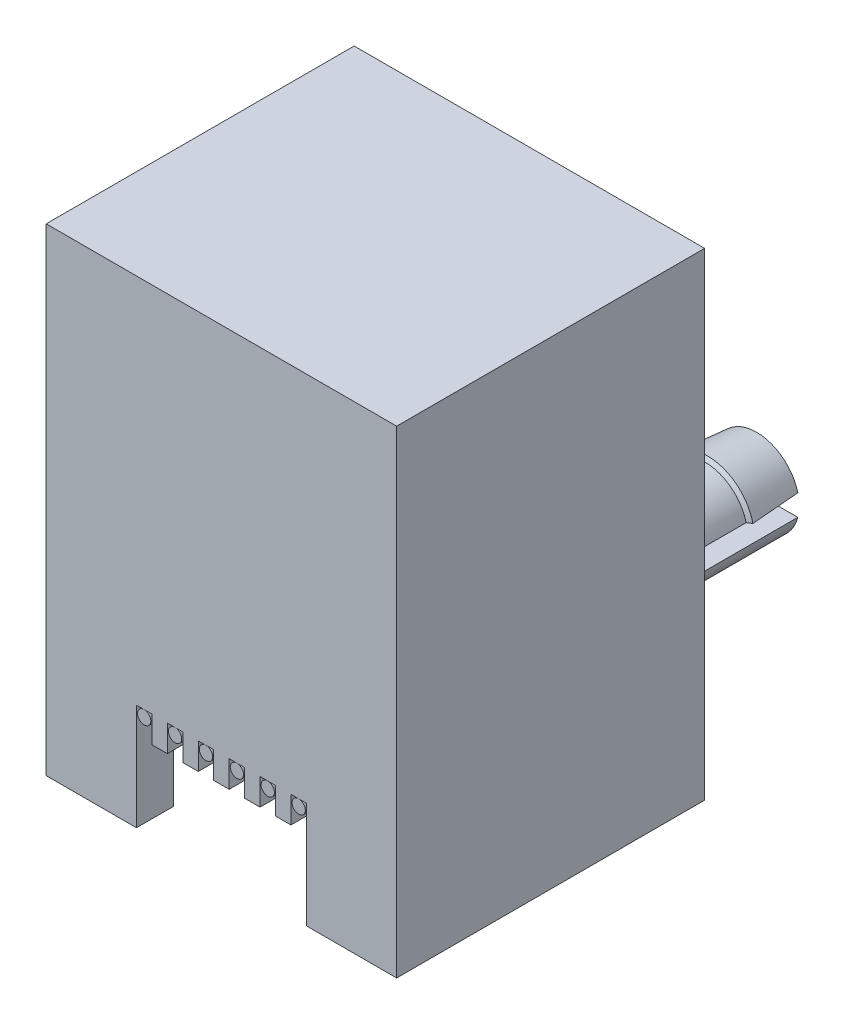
from build123d import *

# Parameters (mm, degrees)
SKETCH1_W          = 13.2
SKETCH1_H          = 11.6
EXTRUDE1_DEPTH     = 9
CUT_EXTRUDE1_DEPTH = 10
SKETCH3_W          = 6.4
SKETCH3_H          = 3
CUT_EXTRUDE2_DEPTH = 1.4
CUT_EXTRUDE3_DEPTH = 1.2
EXTRUDE2_DEPTH     = 3.5
SKETCH9_W          = 0.581818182
SKETCH9_H          = 1
SKETCH9_W_2        = 0.581818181
CUT_EXTRUDE4_DEPTH = 1.4
SKETCH10_W         = 6.6
SKETCH10_H         = 4.1
CUT_EXTRUDE5_DEPTH = 0.3
SKETCH11_W         = 0.581818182
SKETCH11_H         = 6.45
SKETCH11_W_2       = 0.581818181
CUT_EXTRUDE6_DEPTH = 0.6
SKETCH14_R         = 0.25
LPATTERN1_COUNT    = 6
LPATTERN1_PITCH    = 1.1636


with BuildPart() as part:
    # Sketch1 → Extrude1 (new, symmetric)
    with BuildSketch(Plane(origin=(0, 0, 0), x_dir=(1, 0, 0), z_dir=(0, 1, 0))):
        Rectangle(SKETCH1_W, SKETCH1_H)
    extrude(amount=EXTRUDE1_DEPTH, both=True)

    # Sketch2 → Cut-Extrude1 (cut)
    with BuildSketch(Plane.XZ.offset(9)):
        Polygon((5.2, 4.4), (-5.2, 4.4), (-5.2, -2.8), (-3.8, -2.8), (-3.8, -4.6), (3.8, -4.6), (3.8, -2.8), (5.2, -2.8), align=None)
    extrude(amount=-CUT_EXTRUDE1_DEPTH, mode=Mode.SUBTRACT)

    # Sketch3 → Cut-Extrude2 (cut)
    with BuildSketch(Plane.XY.offset(5.8)):
        with Locations((0, -7.5)):
            Rectangle(SKETCH3_W, SKETCH3_H)
    extrude(amount=-CUT_EXTRUDE2_DEPTH, mode=Mode.SUBTRACT)

    # Sketch4 → Cut-Extrude3 (cut)
    with BuildSketch(Plane(origin=(0, 0, -5.8), x_dir=(-1, 0, 0), z_dir=(0, 0, -1))):
        Polygon((2.4, -7.2), (2.4, -9), (-2.4, -9), (-2.4, -7.2), (-3.2, -7.2), (-3.2, -4.2), (3.2, -4.2), (3.2, -7.2), align=None)
    extrude(amount=-CUT_EXTRUDE3_DEPTH, mode=Mode.SUBTRACT)

    # Sketch5 → Extrude2 (add)
    with BuildSketch(Plane(origin=(0, 0, -5.8), x_dir=(-1, 0, 0), z_dir=(0, 0, -1))):
        with BuildLine():
            Line((-6.609193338, -1.52), (-3.510806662, -1.52))
            ThreePointArc((-3.510806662, -1.52), (-5.06, -2.72), (-6.609193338, -1.52))
        make_face()
        with BuildLine():
            Line((-6.609193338, -0.72), (-3.510806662, -0.72))
            ThreePointArc((-3.510806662, -0.72), (-5.06, 0.48), (-6.609193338, -0.72))
        make_face()
    extrude2 = extrude(amount=EXTRUDE2_DEPTH)

    # Sketch8 for Loft1 → Loft1 section 0
    with BuildSketch(Plane(origin=(0, 0, -9.3), x_dir=(-1, 0, 0), z_dir=(0, 0, -1))):
        with BuildLine():
            Line((-6.609193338, -0.72), (-3.510806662, -0.72))
            # circular arc as an exact rational Bezier (weights 1, cos(half-angle), 1)
            Bezier((-3.510806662, -0.72), (-5.06, 5.28), (-6.609193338, -0.72), weights=[1, 0.25, 1])
        make_face()
    # Sketch6 for Loft1 → Loft1 section 1
    with BuildSketch(Plane(origin=(0, 0, -7.4537), x_dir=(-1, 0, 0), z_dir=(0, 0, -1))):
        with BuildLine():
            Line((-6.763672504, -0.72), (-3.356327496, -0.72))
            Bezier((-3.356327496, -0.72), (-5.06, 6.53625), (-6.763672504, -0.72), weights=[1, 0.228571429, 1])
        make_face()
    loft1 = loft()

    # Sketch6_2 for Loft2 → Loft2 section 0
    with BuildSketch(Plane(origin=(0, 0, -7.4537), x_dir=(-1, 0, 0), z_dir=(0, 0, -1))):
        with BuildLine():
            Line((-6.763672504, -0.72), (-3.356327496, -0.72))
            Bezier((-3.356327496, -0.72), (-5.06, 6.53625), (-6.763672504, -0.72), weights=[1, 0.228571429, 1])
        make_face()
    # Sketch7 for Loft2 → Loft2 section 1
    with BuildSketch(Plane(origin=(0, 0, -7.3537), x_dir=(-1, 0, 0), z_dir=(0, 0, -1))):
        with BuildLine():
            Line((-6.609193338, -0.72), (-3.510806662, -0.72))
            Bezier((-3.510806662, -0.72), (-5.06, 5.28), (-6.609193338, -0.72), weights=[1, 0.25, 1])
        make_face()
    loft2 = loft()

    # Mirror1: Extrude2, Loft1, Loft2 across plane
    add(extrude2.mirror(Plane(origin=(0, 0, 0), x_dir=(0, 0, 1), z_dir=(1, 0, 0))))
    add(loft1.mirror(Plane(origin=(0, 0, 0), x_dir=(0, 0, 1), z_dir=(1, 0, 0))))
    add(loft2.mirror(Plane(origin=(0, 0, 0), x_dir=(0, 0, 1), z_dir=(1, 0, 0))))

    # Sketch9 → Cut-Extrude4 (cut)
    with BuildSketch(Plane(origin=(0, 0, 4.4), x_dir=(-1, 0, 0), z_dir=(0, 0, -1))):
        with Locations((2.909090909, -5.5)):
            Rectangle(SKETCH9_W, SKETCH9_H)
        with Locations((1.745454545, -5.5)):
            Rectangle(SKETCH9_W_2, SKETCH9_H)
        with Locations((0.581818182, -5.5)):
            Rectangle(SKETCH9_W, SKETCH9_H)
        with Locations((-0.581818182, -5.5)):
            Rectangle(SKETCH9_W, SKETCH9_H)
        with Locations((-1.745454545, -5.5)):
            Rectangle(SKETCH9_W_2, SKETCH9_H)
        with Locations((-2.909090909, -5.5)):
            Rectangle(SKETCH9_W, SKETCH9_H)
    extrude(amount=-CUT_EXTRUDE4_DEPTH, mode=Mode.SUBTRACT)

    # Sketch10 → Cut-Extrude5 (cut)
    with BuildSketch(Plane.XZ.offset(-1)):
        with Locations((0, -2.05)):
            Rectangle(SKETCH10_W, SKETCH10_H)
    extrude(amount=-CUT_EXTRUDE5_DEPTH, mode=Mode.SUBTRACT)

    # Sketch11 → Cut-Extrude6 (cut)
    with BuildSketch(Plane.XZ.offset(-1)):
        with Locations((2.909090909, 1.175)):
            Rectangle(SKETCH11_W, SKETCH11_H)
        with Locations((1.745454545, 1.175)):
            Rectangle(SKETCH11_W_2, SKETCH11_H)
        with Locations((0.581818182, 1.175)):
            Rectangle(SKETCH11_W, SKETCH11_H)
        with Locations((-0.581818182, 1.175)):
            Rectangle(SKETCH11_W, SKETCH11_H)
        with Locations((-1.745454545, 1.175)):
            Rectangle(SKETCH11_W_2, SKETCH11_H)
        with Locations((-2.909090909, 1.175)):
            Rectangle(SKETCH11_W, SKETCH11_H)
    extrude(amount=-CUT_EXTRUDE6_DEPTH, mode=Mode.SUBTRACT)


with BuildPart() as body_2:
    # Sweep1: sweep along a path in Sketch13
    with BuildLine(Plane(origin=(-2.909090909, 0, 0), x_dir=(0, 0, -1), z_dir=(1, 0, 0))) as sweep1_path:
        Line((-5.8, -5), (-4.819549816, -5))
        ThreePointArc((-4.819549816, -5), (-4.498156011, -4.883022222), (-4.327145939, -4.586824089))
        Line((-4.327145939, -4.586824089), (-3.236241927, 1.6))
    # Sketch14 → Sweep1 (sweep)
    with BuildSketch(Plane.XY.offset(5.8)):
        with Locations((-2.909090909, -5.25)):
            Circle(SKETCH14_R)
    sweep(path=sweep1_path.line)


with BuildPart() as lpattern1_1:
    # LPattern1: pattern copy
    add(body_2.part.moved(Location(Vector(1, 0, 0) * (1 * LPATTERN1_PITCH))))


with BuildPart() as lpattern1_2:
    # LPattern1: pattern copy
    add(body_2.part.moved(Location(Vector(1, 0, 0) * (2 * LPATTERN1_PITCH))))


with BuildPart() as lpattern1_3:
    # LPattern1: pattern copy
    add(body_2.part.moved(Location(Vector(1, 0, 0) * (3 * LPATTERN1_PITCH))))


with BuildPart() as lpattern1_4:
    # LPattern1: pattern copy
    add(body_2.part.moved(Location(Vector(1, 0, 0) * (4 * LPATTERN1_PITCH))))


with BuildPart() as lpattern1_5:
    # LPattern1: pattern copy
    add(body_2.part.moved(Location(Vector(1, 0, 0) * (5 * LPATTERN1_PITCH))))


solid = Compound([part.part, body_2.part, lpattern1_1.part, lpattern1_2.part, lpattern1_3.part, lpattern1_4.part, lpattern1_5.part])
